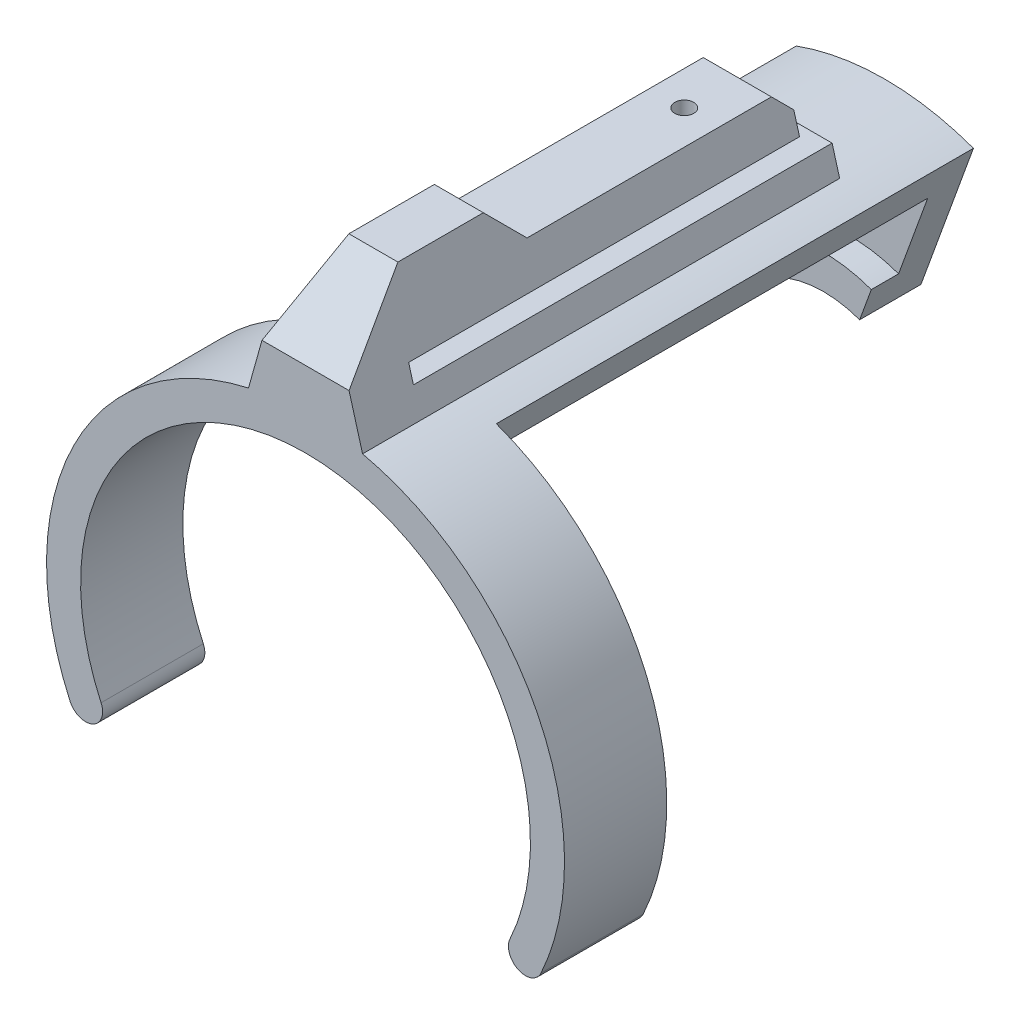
from build123d import *

# Parameters (mm, degrees)
BOSS_EXTRUDE1_DEPTH             = 15
REVOLVE1_ANGLE                  = 40.000000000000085
BOSS_EXTRUDE2_START             = -85
BOSS_EXTRUDE2_DEPTH             = 70
CUT_EXTRUDE1_DEPTH              = 94.55001290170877
CUT_EXTRUDE1_DEPTH_BACK         = 94.55001290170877
SKETCH5_R                       = 1.3999999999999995
CUT_EXTRUDE2_DEPTH              = 65
CUT_EXTRUDE5_START              = -16.203997
SKETCH6_R                       = 3.000000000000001
CUT_EXTRUDE5_DEPTH              = 2.146503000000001
BOSS_EXTRUDE3_REACH             = 95.55
BOSS_EXTRUDE3_DIRECTION_2_REACH = 95.55


with BuildPart() as part:
    # Sketch1 → Boss-Extrude1 (new body)
    with BuildSketch(Plane.XY):
        with BuildLine():
            ThreePointArc((-30, -13.747727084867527), (-6.06e-15, 33), (30, -13.747727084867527))
            ThreePointArc((30, -13.747727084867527), (31.231232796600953, -17.061948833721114), (34.54545454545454, -15.830716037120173))
            ThreePointArc((34.54545454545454, -15.830716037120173), (-6.98e-15, 37.99999999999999), (-34.54545454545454, -15.830716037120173))
            ThreePointArc((-34.54545454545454, -15.830716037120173), (-31.231232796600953, -17.061948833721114), (-30, -13.747727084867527))
        make_face()
    extrude(amount=BOSS_EXTRUDE1_DEPTH)

    # Sketch2 → Revolve1 (revolve, symmetric)
    with BuildSketch(Plane(origin=(0, 0, 0), x_dir=(0, 0, -1), z_dir=(1, 0, 0))) as revolve1_sk:
        Polygon((-15, 38), (70, 38), (70, 15.500000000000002), (61, 15.5), (61, 20.5), (65, 20.5), (65, 33), (-15, 33), align=None)
    revolve(axis=Axis((0, 0, 0), (0, 0, -1)), revolution_arc=REVOLVE1_ANGLE / 2)
    revolve(revolve1_sk.sketch, axis=Axis((0, 0, 0), (0, 0, 1)), revolution_arc=REVOLVE1_ANGLE / 2)

    # Sketch3 → Boss-Extrude2 (add)
    with BuildSketch(Plane(origin=(0, 0, -70), x_dir=(-1, 0, 0), z_dir=(0, 0, -1)).offset(BOSS_EXTRUDE2_START)):
        Polygon((8.367287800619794, 37.067350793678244), (-8.367287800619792, 37.06735079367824), (-5, 49.067350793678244), (5, 49.067350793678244), align=None)
    extrude(amount=BOSS_EXTRUDE2_DEPTH)

    # Sketch4 → Cut-Extrude1 (cut, two sides: drawn at the far end of the back side and taken through both)
    with BuildSketch(Plane(origin=(0, 0, 0), x_dir=(0, 0, -1), z_dir=(1, 0, 0)).offset(-CUT_EXTRUDE1_DEPTH_BACK)):
        Polygon((70.26005505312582, 40.99999999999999), (-6.432404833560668, 40.99999999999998), (-6.4324048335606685, 43.499999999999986), (50.91967347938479, 43.499999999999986), (50.9196734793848, 46.499999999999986), (47.358860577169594, 50.060812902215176), (-9.057694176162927, 50.06081290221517), (-20.051156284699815, 39.067350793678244), (-20.051156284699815, 58.06387040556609), (70.26005505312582, 58.06387040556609), align=None)
    extrude(amount=CUT_EXTRUDE1_DEPTH + CUT_EXTRUDE1_DEPTH_BACK, mode=Mode.SUBTRACT)

    # Sketch5 → Cut-Extrude2 (cut)
    with BuildSketch(Plane(origin=(0, 49.067350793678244, 0), x_dir=(1, 0, 0), z_dir=(0, 1, 0))):
        with Locations(Location((0, 40.56759516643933, 0), (0, 0, 270))):
            Circle(SKETCH5_R)
    extrude(amount=-CUT_EXTRUDE2_DEPTH, mode=Mode.SUBTRACT)

    # Sketch6 → Cut-Extrude5 (cut)
    with BuildSketch(Plane(origin=(0, 49.067350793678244, 0), x_dir=(1, 0, 0), z_dir=(0, 1, 0)).offset(CUT_EXTRUDE5_START)):
        with Locations(Location((0, 40.56759516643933, 0), (0, 0, 90))):
            Circle(SKETCH6_R)
    extrude(amount=CUT_EXTRUDE5_DEPTH, mode=Mode.SUBTRACT)

    # Boss-Extrude3: up to this plane
    boss_extrude3_end = Plane(origin=(8.367287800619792, 37.06735079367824, -55.00000000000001), z_dir=(-0.962812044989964, -0.27017210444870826, 0))
    # Sketch8 → Boss-Extrude3 (add, up to the surface)
    with BuildSketch(Plane(origin=(0, 0, 0), x_dir=(0, 0, -1), z_dir=(1, 0, 0)), mode=Mode.PRIVATE) as boss_extrude3_sk1:
        Polygon((-14.66121410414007, 44.457292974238), (-5.043535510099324, 54.07497156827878), (7.495228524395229, 54.07497156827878), (12.502849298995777, 49.067350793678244), (12.502849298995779, 43.499999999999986), align=None)
    boss_extrude3_tool1 = split(extrude(boss_extrude3_sk1.sketch, amount=BOSS_EXTRUDE3_REACH, mode=Mode.PRIVATE), bisect_by=boss_extrude3_end, keep=Keep.BOTH, mode=Mode.PRIVATE)
    add(boss_extrude3_tool1.solids().sort_by_distance((0, 48.429936, -0.728013))[0])

    # Boss-Extrude3 direction 2: up to this plane
    boss_extrude3_direction_2_end = Plane(origin=(-8.367287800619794, 37.067350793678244, -55.00000000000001), z_dir=(0.9628120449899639, -0.27017210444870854, 0))
    # Sketch8 → Boss-Extrude3 direction 2 (add, up to the surface)
    with BuildSketch(Plane(origin=(0, 0, 0), x_dir=(0, 0, -1), z_dir=(1, 0, 0)), mode=Mode.PRIVATE) as boss_extrude3_direction_2_sk1:
        Polygon((-14.66121410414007, 44.457292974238), (-5.043535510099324, 54.07497156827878), (7.495228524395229, 54.07497156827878), (12.502849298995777, 49.067350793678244), (12.502849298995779, 43.499999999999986), align=None)
    boss_extrude3_direction_2_tool1 = split(extrude(boss_extrude3_direction_2_sk1.sketch, amount=-BOSS_EXTRUDE3_DIRECTION_2_REACH, mode=Mode.PRIVATE), bisect_by=boss_extrude3_direction_2_end, keep=Keep.BOTH, mode=Mode.PRIVATE)
    add(boss_extrude3_direction_2_tool1.solids().sort_by_distance((0, 48.429936, -0.728013))[0])


solid = part.part
